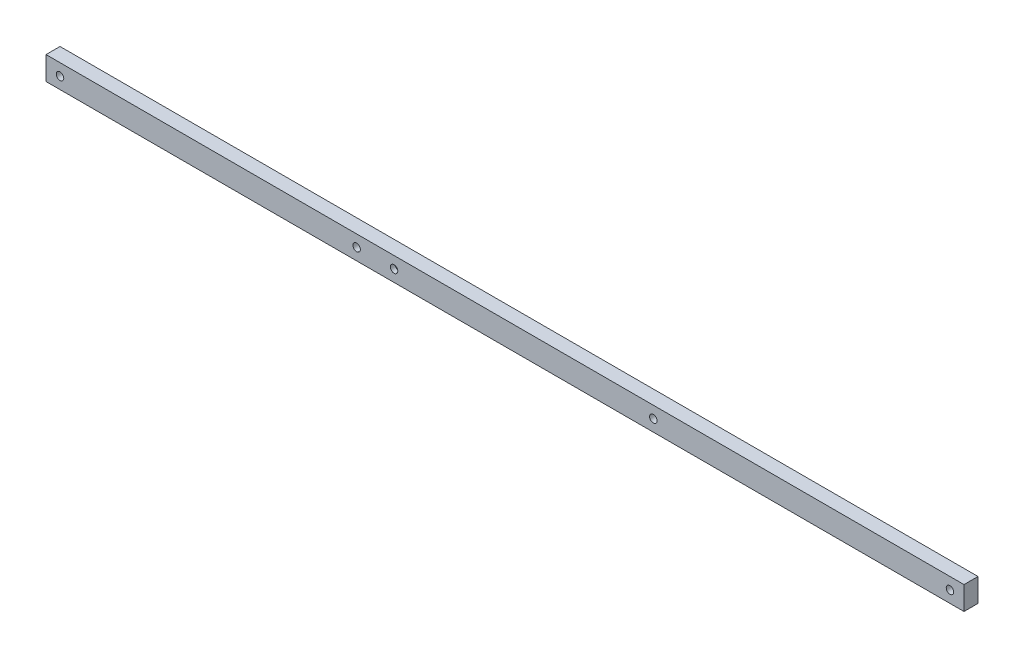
ISO-10303-21;
HEADER;
FILE_DESCRIPTION(('STEP AP214'),'2;1');
FILE_NAME('part.step','',(''),(''),'','','');
FILE_SCHEMA(('AUTOMOTIVE_DESIGN { 1 0 10303 214 1 1 1 1 }'));
ENDSEC;
DATA;
#1=APPLICATION_CONTEXT('core data for automotive mechanical design processes');
#2=APPLICATION_PROTOCOL_DEFINITION('international standard','automotive_design',2000,#1);
#3=PRODUCT_CONTEXT('',#1,'mechanical');
#4=PRODUCT('Part','Part','',(#3));
#5=PRODUCT_RELATED_PRODUCT_CATEGORY('part','',(#4));
#6=PRODUCT_DEFINITION_FORMATION('','',#4);
#7=PRODUCT_DEFINITION_CONTEXT('part definition',#1,'design');
#8=PRODUCT_DEFINITION('design','',#6,#7);
#9=PRODUCT_DEFINITION_SHAPE('','',#8);
#10=(LENGTH_UNIT() NAMED_UNIT(*) SI_UNIT(.MILLI.,.METRE.));
#11=(NAMED_UNIT(*) PLANE_ANGLE_UNIT() SI_UNIT($,.RADIAN.));
#12=(NAMED_UNIT(*) SI_UNIT($,.STERADIAN.) SOLID_ANGLE_UNIT());
#13=UNCERTAINTY_MEASURE_WITH_UNIT(LENGTH_MEASURE(1.E-05),#10,'distance_accuracy_value','');
#14=(GEOMETRIC_REPRESENTATION_CONTEXT(3) GLOBAL_UNCERTAINTY_ASSIGNED_CONTEXT((#13)) GLOBAL_UNIT_ASSIGNED_CONTEXT((#10,
#11,#12)) REPRESENTATION_CONTEXT('',''));
#15=CARTESIAN_POINT('',(0.,0.,0.));
#16=DIRECTION('',(0.,0.,1.));
#17=DIRECTION('',(1.,0.,0.));
#18=AXIS2_PLACEMENT_3D('',#15,#16,#17);
#19=CARTESIAN_POINT('',(0.,9.99999999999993,6.));
#20=DIRECTION('',(0.,0.,-1.));
#21=DIRECTION('',(-1.,0.,0.));
#22=AXIS2_PLACEMENT_3D('',#19,#20,#21);
#23=PLANE('',#22);
#24=CARTESIAN_POINT('',(149.,5.,6.));
#25=DIRECTION('',(0.,0.,1.));
#26=DIRECTION('',(1.,0.,0.));
#27=AXIS2_PLACEMENT_3D('',#24,#25,#26);
#28=CIRCLE('',#27,1.59999999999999);
#29=CARTESIAN_POINT('',(150.6,5.,6.));
#30=VERTEX_POINT('',#29);
#31=EDGE_CURVE('E231',#30,#30,#28,.T.);
#32=ORIENTED_EDGE('',*,*,#31,.F.);
#33=EDGE_LOOP('',(#32));
#34=FACE_BOUND('',#33,.T.);
#35=CARTESIAN_POINT('',(260.,5.,6.));
#36=DIRECTION('',(0.,0.,1.));
#37=DIRECTION('',(1.,0.,0.));
#38=AXIS2_PLACEMENT_3D('',#35,#36,#37);
#39=CIRCLE('',#38,1.60000000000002);
#40=CARTESIAN_POINT('',(261.6,5.,6.));
#41=VERTEX_POINT('',#40);
#42=EDGE_CURVE('E124',#41,#41,#39,.T.);
#43=ORIENTED_EDGE('',*,*,#42,.F.);
#44=EDGE_LOOP('',(#43));
#45=FACE_BOUND('',#44,.T.);
#46=CARTESIAN_POINT('',(133.,5.,6.));
#47=DIRECTION('',(0.,0.,1.));
#48=DIRECTION('',(1.,0.,0.));
#49=AXIS2_PLACEMENT_3D('',#46,#47,#48);
#50=CIRCLE('',#49,1.59999999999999);
#51=CARTESIAN_POINT('',(134.6,5.,6.));
#52=VERTEX_POINT('',#51);
#53=EDGE_CURVE('E86',#52,#52,#50,.T.);
#54=ORIENTED_EDGE('',*,*,#53,.F.);
#55=EDGE_LOOP('',(#54));
#56=FACE_BOUND('',#55,.T.);
#57=DIRECTION('',(0.,-1.,0.));
#58=VECTOR('',#57,1.);
#59=CARTESIAN_POINT('',(0.,0.,6.));
#60=LINE('',#59,#58);
#61=CARTESIAN_POINT('',(0.,9.99999999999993,6.));
#62=VERTEX_POINT('',#61);
#63=CARTESIAN_POINT('',(0.,0.,6.));
#64=VERTEX_POINT('',#63);
#65=EDGE_CURVE('E96',#62,#64,#60,.T.);
#66=ORIENTED_EDGE('',*,*,#65,.T.);
#67=DIRECTION('',(1.,0.,0.));
#68=VECTOR('',#67,1.);
#69=CARTESIAN_POINT('',(0.,0.,6.));
#70=LINE('',#69,#68);
#71=CARTESIAN_POINT('',(393.,0.,6.));
#72=VERTEX_POINT('',#71);
#73=EDGE_CURVE('E81',#64,#72,#70,.T.);
#74=ORIENTED_EDGE('',*,*,#73,.T.);
#75=DIRECTION('',(0.,1.,0.));
#76=VECTOR('',#75,1.);
#77=CARTESIAN_POINT('',(393.,0.,6.));
#78=LINE('',#77,#76);
#79=CARTESIAN_POINT('',(393.,9.99999999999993,6.));
#80=VERTEX_POINT('',#79);
#81=EDGE_CURVE('E47',#72,#80,#78,.T.);
#82=ORIENTED_EDGE('',*,*,#81,.T.);
#83=DIRECTION('',(-1.,0.,0.));
#84=VECTOR('',#83,1.);
#85=CARTESIAN_POINT('',(0.,9.99999999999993,6.));
#86=LINE('',#85,#84);
#87=EDGE_CURVE('E42',#80,#62,#86,.T.);
#88=ORIENTED_EDGE('',*,*,#87,.T.);
#89=EDGE_LOOP('',(#66,#74,#82,#88));
#90=FACE_BOUND('',#89,.T.);
#91=CARTESIAN_POINT('',(6.,5.,6.));
#92=DIRECTION('',(0.,0.,1.));
#93=DIRECTION('',(1.,0.,0.));
#94=AXIS2_PLACEMENT_3D('',#91,#92,#93);
#95=CIRCLE('',#94,1.6);
#96=CARTESIAN_POINT('',(7.6,5.,6.));
#97=VERTEX_POINT('',#96);
#98=EDGE_CURVE('E115',#97,#97,#95,.T.);
#99=ORIENTED_EDGE('',*,*,#98,.F.);
#100=EDGE_LOOP('',(#99));
#101=FACE_BOUND('',#100,.T.);
#102=CARTESIAN_POINT('',(387.,5.,6.));
#103=DIRECTION('',(0.,0.,1.));
#104=DIRECTION('',(1.,0.,0.));
#105=AXIS2_PLACEMENT_3D('',#102,#103,#104);
#106=CIRCLE('',#105,1.60000000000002);
#107=CARTESIAN_POINT('',(388.6,5.,6.));
#108=VERTEX_POINT('',#107);
#109=EDGE_CURVE('E118',#108,#108,#106,.T.);
#110=ORIENTED_EDGE('',*,*,#109,.F.);
#111=EDGE_LOOP('',(#110));
#112=FACE_BOUND('',#111,.T.);
#113=ADVANCED_FACE('F27',(#34,#45,#56,#90,#101,#112),#23,.F.);
#114=CARTESIAN_POINT('',(0.,9.99999999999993,0.));
#115=DIRECTION('',(0.,0.,-1.));
#116=DIRECTION('',(-1.,0.,0.));
#117=AXIS2_PLACEMENT_3D('',#114,#115,#116);
#118=PLANE('',#117);
#119=CARTESIAN_POINT('',(260.,5.,0.));
#120=DIRECTION('',(0.,0.,1.));
#121=DIRECTION('',(1.,0.,0.));
#122=AXIS2_PLACEMENT_3D('',#119,#120,#121);
#123=CIRCLE('',#122,1.60000000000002);
#124=CARTESIAN_POINT('',(261.6,5.,0.));
#125=VERTEX_POINT('',#124);
#126=EDGE_CURVE('E120',#125,#125,#123,.T.);
#127=ORIENTED_EDGE('',*,*,#126,.T.);
#128=EDGE_LOOP('',(#127));
#129=FACE_BOUND('',#128,.T.);
#130=CARTESIAN_POINT('',(133.,5.,0.));
#131=DIRECTION('',(0.,0.,1.));
#132=DIRECTION('',(1.,0.,0.));
#133=AXIS2_PLACEMENT_3D('',#130,#131,#132);
#134=CIRCLE('',#133,1.59999999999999);
#135=CARTESIAN_POINT('',(134.6,5.,0.));
#136=VERTEX_POINT('',#135);
#137=EDGE_CURVE('E89',#136,#136,#134,.T.);
#138=ORIENTED_EDGE('',*,*,#137,.T.);
#139=EDGE_LOOP('',(#138));
#140=FACE_BOUND('',#139,.T.);
#141=DIRECTION('',(0.,-1.,0.));
#142=VECTOR('',#141,1.);
#143=CARTESIAN_POINT('',(0.,0.,0.));
#144=LINE('',#143,#142);
#145=CARTESIAN_POINT('',(0.,9.99999999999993,0.));
#146=VERTEX_POINT('',#145);
#147=CARTESIAN_POINT('',(0.,0.,0.));
#148=VERTEX_POINT('',#147);
#149=EDGE_CURVE('E73',#146,#148,#144,.T.);
#150=ORIENTED_EDGE('',*,*,#149,.F.);
#151=DIRECTION('',(-1.,0.,0.));
#152=VECTOR('',#151,1.);
#153=CARTESIAN_POINT('',(0.,9.99999999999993,0.));
#154=LINE('',#153,#152);
#155=CARTESIAN_POINT('',(393.,9.99999999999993,0.));
#156=VERTEX_POINT('',#155);
#157=EDGE_CURVE('E94',#156,#146,#154,.T.);
#158=ORIENTED_EDGE('',*,*,#157,.F.);
#159=DIRECTION('',(0.,1.,0.));
#160=VECTOR('',#159,1.);
#161=CARTESIAN_POINT('',(393.,0.,0.));
#162=LINE('',#161,#160);
#163=CARTESIAN_POINT('',(393.,0.,0.));
#164=VERTEX_POINT('',#163);
#165=EDGE_CURVE('E74',#164,#156,#162,.T.);
#166=ORIENTED_EDGE('',*,*,#165,.F.);
#167=DIRECTION('',(1.,0.,0.));
#168=VECTOR('',#167,1.);
#169=CARTESIAN_POINT('',(0.,0.,0.));
#170=LINE('',#169,#168);
#171=EDGE_CURVE('E68',#148,#164,#170,.T.);
#172=ORIENTED_EDGE('',*,*,#171,.F.);
#173=EDGE_LOOP('',(#150,#158,#166,#172));
#174=FACE_BOUND('',#173,.T.);
#175=CARTESIAN_POINT('',(6.,5.,0.));
#176=DIRECTION('',(0.,0.,1.));
#177=DIRECTION('',(1.,0.,0.));
#178=AXIS2_PLACEMENT_3D('',#175,#176,#177);
#179=CIRCLE('',#178,1.6);
#180=CARTESIAN_POINT('',(7.6,5.,0.));
#181=VERTEX_POINT('',#180);
#182=EDGE_CURVE('E133',#181,#181,#179,.T.);
#183=ORIENTED_EDGE('',*,*,#182,.T.);
#184=EDGE_LOOP('',(#183));
#185=FACE_BOUND('',#184,.T.);
#186=CARTESIAN_POINT('',(387.,5.,0.));
#187=DIRECTION('',(0.,0.,1.));
#188=DIRECTION('',(1.,0.,0.));
#189=AXIS2_PLACEMENT_3D('',#186,#187,#188);
#190=CIRCLE('',#189,1.60000000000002);
#191=CARTESIAN_POINT('',(388.6,5.,0.));
#192=VERTEX_POINT('',#191);
#193=EDGE_CURVE('E121',#192,#192,#190,.T.);
#194=ORIENTED_EDGE('',*,*,#193,.T.);
#195=EDGE_LOOP('',(#194));
#196=FACE_BOUND('',#195,.T.);
#197=ADVANCED_FACE('F69',(#129,#140,#174,#185,#196),#118,.T.);
#198=CARTESIAN_POINT('',(0.,0.,6.));
#199=DIRECTION('',(1.,0.,0.));
#200=DIRECTION('',(0.,0.,-1.));
#201=AXIS2_PLACEMENT_3D('',#198,#199,#200);
#202=PLANE('',#201);
#203=ORIENTED_EDGE('',*,*,#149,.T.);
#204=DIRECTION('',(0.,0.,-1.));
#205=VECTOR('',#204,1.);
#206=CARTESIAN_POINT('',(0.,0.,6.));
#207=LINE('',#206,#205);
#208=EDGE_CURVE('E11',#64,#148,#207,.T.);
#209=ORIENTED_EDGE('',*,*,#208,.F.);
#210=ORIENTED_EDGE('',*,*,#65,.F.);
#211=DIRECTION('',(0.,0.,-1.));
#212=VECTOR('',#211,1.);
#213=CARTESIAN_POINT('',(0.,9.99999999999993,6.));
#214=LINE('',#213,#212);
#215=EDGE_CURVE('E85',#62,#146,#214,.T.);
#216=ORIENTED_EDGE('',*,*,#215,.T.);
#217=EDGE_LOOP('',(#203,#209,#210,#216));
#218=FACE_BOUND('',#217,.T.);
#219=ADVANCED_FACE('F29',(#218),#202,.F.);
#220=CARTESIAN_POINT('',(0.,0.,6.));
#221=DIRECTION('',(0.,1.,0.));
#222=DIRECTION('',(0.,0.,1.));
#223=AXIS2_PLACEMENT_3D('',#220,#221,#222);
#224=PLANE('',#223);
#225=ORIENTED_EDGE('',*,*,#171,.T.);
#226=DIRECTION('',(0.,0.,-1.));
#227=VECTOR('',#226,1.);
#228=CARTESIAN_POINT('',(393.,0.,6.));
#229=LINE('',#228,#227);
#230=EDGE_CURVE('E35',#72,#164,#229,.T.);
#231=ORIENTED_EDGE('',*,*,#230,.F.);
#232=ORIENTED_EDGE('',*,*,#73,.F.);
#233=ORIENTED_EDGE('',*,*,#208,.T.);
#234=EDGE_LOOP('',(#225,#231,#232,#233));
#235=FACE_BOUND('',#234,.T.);
#236=ADVANCED_FACE('F80',(#235),#224,.F.);
#237=CARTESIAN_POINT('',(393.,0.,6.));
#238=DIRECTION('',(-1.,0.,0.));
#239=DIRECTION('',(0.,0.,1.));
#240=AXIS2_PLACEMENT_3D('',#237,#238,#239);
#241=PLANE('',#240);
#242=ORIENTED_EDGE('',*,*,#165,.T.);
#243=DIRECTION('',(0.,0.,-1.));
#244=VECTOR('',#243,1.);
#245=CARTESIAN_POINT('',(393.,9.99999999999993,6.));
#246=LINE('',#245,#244);
#247=EDGE_CURVE('E102',#80,#156,#246,.T.);
#248=ORIENTED_EDGE('',*,*,#247,.F.);
#249=ORIENTED_EDGE('',*,*,#81,.F.);
#250=ORIENTED_EDGE('',*,*,#230,.T.);
#251=EDGE_LOOP('',(#242,#248,#249,#250));
#252=FACE_BOUND('',#251,.T.);
#253=ADVANCED_FACE('F105',(#252),#241,.F.);
#254=CARTESIAN_POINT('',(0.,9.99999999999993,6.));
#255=DIRECTION('',(0.,-1.,0.));
#256=DIRECTION('',(0.,0.,-1.));
#257=AXIS2_PLACEMENT_3D('',#254,#255,#256);
#258=PLANE('',#257);
#259=ORIENTED_EDGE('',*,*,#157,.T.);
#260=ORIENTED_EDGE('',*,*,#215,.F.);
#261=ORIENTED_EDGE('',*,*,#87,.F.);
#262=ORIENTED_EDGE('',*,*,#247,.T.);
#263=EDGE_LOOP('',(#259,#260,#261,#262));
#264=FACE_BOUND('',#263,.T.);
#265=ADVANCED_FACE('F107',(#264),#258,.F.);
#266=CARTESIAN_POINT('',(133.,5.,6.));
#267=DIRECTION('',(0.,0.,-1.));
#268=DIRECTION('',(-1.,0.,0.));
#269=AXIS2_PLACEMENT_3D('',#266,#267,#268);
#270=CYLINDRICAL_SURFACE('',#269,1.59999999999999);
#271=ORIENTED_EDGE('',*,*,#53,.T.);
#272=EDGE_LOOP('',(#271));
#273=FACE_BOUND('',#272,.T.);
#274=ORIENTED_EDGE('',*,*,#137,.F.);
#275=EDGE_LOOP('',(#274));
#276=FACE_BOUND('',#275,.T.);
#277=ADVANCED_FACE('F140',(#273,#276),#270,.F.);
#278=CARTESIAN_POINT('',(6.,5.,6.));
#279=DIRECTION('',(0.,0.,-1.));
#280=DIRECTION('',(-1.,0.,0.));
#281=AXIS2_PLACEMENT_3D('',#278,#279,#280);
#282=CYLINDRICAL_SURFACE('',#281,1.6);
#283=ORIENTED_EDGE('',*,*,#98,.T.);
#284=EDGE_LOOP('',(#283));
#285=FACE_BOUND('',#284,.T.);
#286=ORIENTED_EDGE('',*,*,#182,.F.);
#287=EDGE_LOOP('',(#286));
#288=FACE_BOUND('',#287,.T.);
#289=ADVANCED_FACE('F142',(#285,#288),#282,.F.);
#290=CARTESIAN_POINT('',(260.,5.,6.));
#291=DIRECTION('',(0.,0.,-1.));
#292=DIRECTION('',(-1.,0.,0.));
#293=AXIS2_PLACEMENT_3D('',#290,#291,#292);
#294=CYLINDRICAL_SURFACE('',#293,1.60000000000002);
#295=ORIENTED_EDGE('',*,*,#42,.T.);
#296=EDGE_LOOP('',(#295));
#297=FACE_BOUND('',#296,.T.);
#298=ORIENTED_EDGE('',*,*,#126,.F.);
#299=EDGE_LOOP('',(#298));
#300=FACE_BOUND('',#299,.T.);
#301=ADVANCED_FACE('F149',(#297,#300),#294,.F.);
#302=CARTESIAN_POINT('',(387.,5.,6.));
#303=DIRECTION('',(0.,0.,-1.));
#304=DIRECTION('',(-1.,0.,0.));
#305=AXIS2_PLACEMENT_3D('',#302,#303,#304);
#306=CYLINDRICAL_SURFACE('',#305,1.60000000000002);
#307=ORIENTED_EDGE('',*,*,#109,.T.);
#308=EDGE_LOOP('',(#307));
#309=FACE_BOUND('',#308,.T.);
#310=ORIENTED_EDGE('',*,*,#193,.F.);
#311=EDGE_LOOP('',(#310));
#312=FACE_BOUND('',#311,.T.);
#313=ADVANCED_FACE('F177',(#309,#312),#306,.F.);
#314=CARTESIAN_POINT('',(149.,5.,4.));
#315=DIRECTION('',(0.,0.,1.));
#316=DIRECTION('',(1.,0.,0.));
#317=AXIS2_PLACEMENT_3D('',#314,#315,#316);
#318=CYLINDRICAL_SURFACE('',#317,1.59999999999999);
#319=CARTESIAN_POINT('',(149.,5.,4.));
#320=DIRECTION('',(0.,0.,1.));
#321=DIRECTION('',(1.,0.,0.));
#322=AXIS2_PLACEMENT_3D('',#319,#320,#321);
#323=CIRCLE('',#322,1.59999999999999);
#324=CARTESIAN_POINT('',(150.6,5.,4.));
#325=VERTEX_POINT('',#324);
#326=EDGE_CURVE('E127',#325,#325,#323,.T.);
#327=ORIENTED_EDGE('',*,*,#326,.F.);
#328=EDGE_LOOP('',(#327));
#329=FACE_BOUND('',#328,.T.);
#330=ORIENTED_EDGE('',*,*,#31,.T.);
#331=EDGE_LOOP('',(#330));
#332=FACE_BOUND('',#331,.T.);
#333=ADVANCED_FACE('F181',(#329,#332),#318,.F.);
#334=CARTESIAN_POINT('',(149.,5.,4.));
#335=DIRECTION('',(0.,0.,1.));
#336=DIRECTION('',(1.,0.,0.));
#337=AXIS2_PLACEMENT_3D('',#334,#335,#336);
#338=PLANE('',#337);
#339=ORIENTED_EDGE('',*,*,#326,.T.);
#340=EDGE_LOOP('',(#339));
#341=FACE_BOUND('',#340,.T.);
#342=ADVANCED_FACE('F185',(#341),#338,.T.);
#343=CLOSED_SHELL('',(#113,#197,#219,#236,#253,#265,#277,#289,#301,#313,#333,#342));
#344=MANIFOLD_SOLID_BREP('B2',#343);
#345=ADVANCED_BREP_SHAPE_REPRESENTATION('',(#18,#344),#14);
#346=SHAPE_DEFINITION_REPRESENTATION(#9,#345);
ENDSEC;
END-ISO-10303-21;
